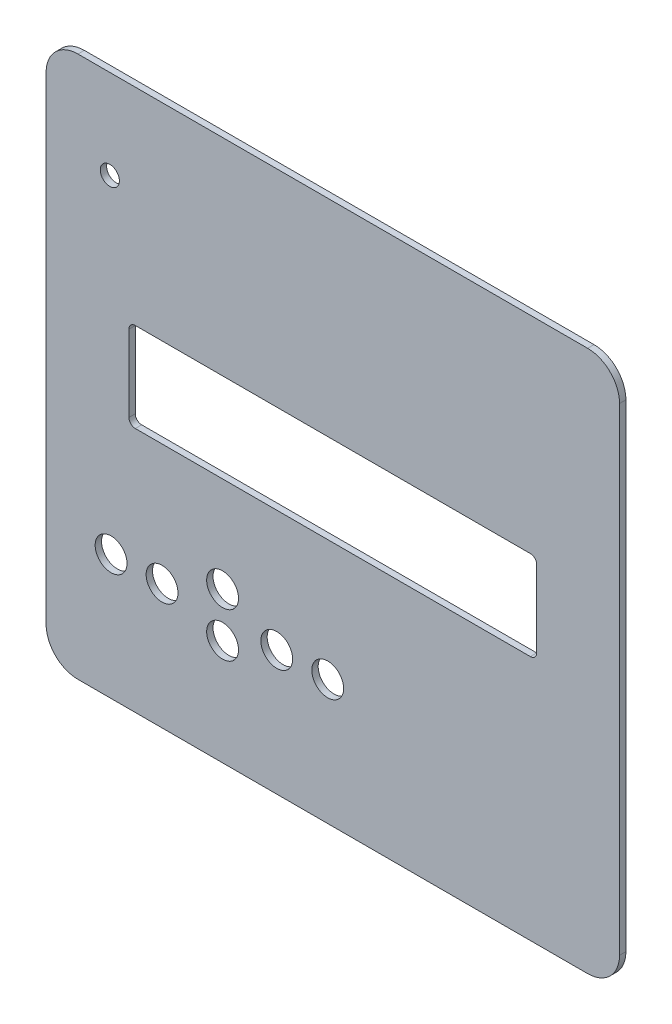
ISO-10303-21;
HEADER;
FILE_DESCRIPTION(('STEP AP214'),'2;1');
FILE_NAME('part.step','',(''),(''),'','','');
FILE_SCHEMA(('AUTOMOTIVE_DESIGN { 1 0 10303 214 1 1 1 1 }'));
ENDSEC;
DATA;
#1=APPLICATION_CONTEXT('core data for automotive mechanical design processes');
#2=APPLICATION_PROTOCOL_DEFINITION('international standard','automotive_design',2000,#1);
#3=PRODUCT_CONTEXT('',#1,'mechanical');
#4=PRODUCT('Part','Part','',(#3));
#5=PRODUCT_RELATED_PRODUCT_CATEGORY('part','',(#4));
#6=PRODUCT_DEFINITION_FORMATION('','',#4);
#7=PRODUCT_DEFINITION_CONTEXT('part definition',#1,'design');
#8=PRODUCT_DEFINITION('design','',#6,#7);
#9=PRODUCT_DEFINITION_SHAPE('','',#8);
#10=(LENGTH_UNIT() NAMED_UNIT(*) SI_UNIT(.MILLI.,.METRE.));
#11=(NAMED_UNIT(*) PLANE_ANGLE_UNIT() SI_UNIT($,.RADIAN.));
#12=(NAMED_UNIT(*) SI_UNIT($,.STERADIAN.) SOLID_ANGLE_UNIT());
#13=UNCERTAINTY_MEASURE_WITH_UNIT(LENGTH_MEASURE(1.E-05),#10,'distance_accuracy_value','');
#14=(GEOMETRIC_REPRESENTATION_CONTEXT(3) GLOBAL_UNCERTAINTY_ASSIGNED_CONTEXT((#13)) GLOBAL_UNIT_ASSIGNED_CONTEXT((#10,
#11,#12)) REPRESENTATION_CONTEXT('',''));
#15=CARTESIAN_POINT('',(0.,0.,0.));
#16=DIRECTION('',(0.,0.,1.));
#17=DIRECTION('',(1.,0.,0.));
#18=AXIS2_PLACEMENT_3D('',#15,#16,#17);
#19=CARTESIAN_POINT('',(40.,-37.5,1.));
#20=DIRECTION('',(0.,0.,-1.));
#21=DIRECTION('',(-1.,0.,0.));
#22=AXIS2_PLACEMENT_3D('',#19,#20,#21);
#23=CYLINDRICAL_SURFACE('',#22,5.);
#24=CARTESIAN_POINT('',(40.,-37.5,0.));
#25=DIRECTION('',(0.,0.,1.));
#26=DIRECTION('',(1.,0.,0.));
#27=AXIS2_PLACEMENT_3D('',#24,#25,#26);
#28=CIRCLE('',#27,5.);
#29=CARTESIAN_POINT('',(40.,-42.5,0.));
#30=VERTEX_POINT('',#29);
#31=CARTESIAN_POINT('',(45.,-37.5,0.));
#32=VERTEX_POINT('',#31);
#33=EDGE_CURVE('E208',#30,#32,#28,.T.);
#34=ORIENTED_EDGE('',*,*,#33,.T.);
#35=DIRECTION('',(0.,0.,-1.));
#36=VECTOR('',#35,1.);
#37=CARTESIAN_POINT('',(45.,-37.5,1.));
#38=LINE('',#37,#36);
#39=CARTESIAN_POINT('',(45.,-37.5,1.));
#40=VERTEX_POINT('',#39);
#41=EDGE_CURVE('E11',#40,#32,#38,.T.);
#42=ORIENTED_EDGE('',*,*,#41,.F.);
#43=CARTESIAN_POINT('',(40.,-37.5,1.));
#44=DIRECTION('',(0.,0.,1.));
#45=DIRECTION('',(1.,0.,0.));
#46=AXIS2_PLACEMENT_3D('',#43,#44,#45);
#47=CIRCLE('',#46,5.);
#48=CARTESIAN_POINT('',(40.,-42.5,1.));
#49=VERTEX_POINT('',#48);
#50=EDGE_CURVE('E220',#49,#40,#47,.T.);
#51=ORIENTED_EDGE('',*,*,#50,.F.);
#52=DIRECTION('',(0.,0.,-1.));
#53=VECTOR('',#52,1.);
#54=CARTESIAN_POINT('',(40.,-42.5,1.));
#55=LINE('',#54,#53);
#56=EDGE_CURVE('E238',#49,#30,#55,.T.);
#57=ORIENTED_EDGE('',*,*,#56,.T.);
#58=EDGE_LOOP('',(#34,#42,#51,#57));
#59=FACE_BOUND('',#58,.T.);
#60=ADVANCED_FACE('F35',(#59),#23,.T.);
#61=CARTESIAN_POINT('',(45.,37.5,1.));
#62=DIRECTION('',(-1.,0.,0.));
#63=DIRECTION('',(0.,-1.,0.));
#64=AXIS2_PLACEMENT_3D('',#61,#62,#63);
#65=PLANE('',#64);
#66=DIRECTION('',(0.,1.,0.));
#67=VECTOR('',#66,1.);
#68=CARTESIAN_POINT('',(45.,37.5,0.));
#69=LINE('',#68,#67);
#70=CARTESIAN_POINT('',(45.,37.5,0.));
#71=VERTEX_POINT('',#70);
#72=EDGE_CURVE('E241',#32,#71,#69,.T.);
#73=ORIENTED_EDGE('',*,*,#72,.T.);
#74=DIRECTION('',(0.,0.,-1.));
#75=VECTOR('',#74,1.);
#76=CARTESIAN_POINT('',(45.,37.5,1.));
#77=LINE('',#76,#75);
#78=CARTESIAN_POINT('',(45.,37.5,1.));
#79=VERTEX_POINT('',#78);
#80=EDGE_CURVE('E42',#79,#71,#77,.T.);
#81=ORIENTED_EDGE('',*,*,#80,.F.);
#82=DIRECTION('',(0.,1.,0.));
#83=VECTOR('',#82,1.);
#84=CARTESIAN_POINT('',(45.,37.5,1.));
#85=LINE('',#84,#83);
#86=EDGE_CURVE('E223',#40,#79,#85,.T.);
#87=ORIENTED_EDGE('',*,*,#86,.F.);
#88=ORIENTED_EDGE('',*,*,#41,.T.);
#89=EDGE_LOOP('',(#73,#81,#87,#88));
#90=FACE_BOUND('',#89,.T.);
#91=ADVANCED_FACE('F296',(#90),#65,.F.);
#92=CARTESIAN_POINT('',(40.,37.5,1.));
#93=DIRECTION('',(0.,0.,-1.));
#94=DIRECTION('',(-1.,0.,0.));
#95=AXIS2_PLACEMENT_3D('',#92,#93,#94);
#96=CYLINDRICAL_SURFACE('',#95,5.);
#97=CARTESIAN_POINT('',(40.,37.5,0.));
#98=DIRECTION('',(0.,0.,1.));
#99=DIRECTION('',(-1.,0.,0.));
#100=AXIS2_PLACEMENT_3D('',#97,#98,#99);
#101=CIRCLE('',#100,5.);
#102=CARTESIAN_POINT('',(39.9999999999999,42.5,0.));
#103=VERTEX_POINT('',#102);
#104=EDGE_CURVE('E243',#71,#103,#101,.T.);
#105=ORIENTED_EDGE('',*,*,#104,.T.);
#106=DIRECTION('',(0.,0.,-1.));
#107=VECTOR('',#106,1.);
#108=CARTESIAN_POINT('',(39.9999999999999,42.5,1.));
#109=LINE('',#108,#107);
#110=CARTESIAN_POINT('',(39.9999999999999,42.5,1.));
#111=VERTEX_POINT('',#110);
#112=EDGE_CURVE('E268',#111,#103,#109,.T.);
#113=ORIENTED_EDGE('',*,*,#112,.F.);
#114=CARTESIAN_POINT('',(40.,37.5,1.));
#115=DIRECTION('',(0.,0.,1.));
#116=DIRECTION('',(-1.,0.,0.));
#117=AXIS2_PLACEMENT_3D('',#114,#115,#116);
#118=CIRCLE('',#117,5.);
#119=EDGE_CURVE('E226',#79,#111,#118,.T.);
#120=ORIENTED_EDGE('',*,*,#119,.F.);
#121=ORIENTED_EDGE('',*,*,#80,.T.);
#122=EDGE_LOOP('',(#105,#113,#120,#121));
#123=FACE_BOUND('',#122,.T.);
#124=ADVANCED_FACE('F275',(#123),#96,.T.);
#125=CARTESIAN_POINT('',(-40.,42.5,1.));
#126=DIRECTION('',(0.,-1.,0.));
#127=DIRECTION('',(0.,0.,-1.));
#128=AXIS2_PLACEMENT_3D('',#125,#126,#127);
#129=PLANE('',#128);
#130=DIRECTION('',(-1.,0.,0.));
#131=VECTOR('',#130,1.);
#132=CARTESIAN_POINT('',(-40.,42.5,0.));
#133=LINE('',#132,#131);
#134=CARTESIAN_POINT('',(-40.,42.5,0.));
#135=VERTEX_POINT('',#134);
#136=EDGE_CURVE('E245',#103,#135,#133,.T.);
#137=ORIENTED_EDGE('',*,*,#136,.T.);
#138=DIRECTION('',(0.,0.,-1.));
#139=VECTOR('',#138,1.);
#140=CARTESIAN_POINT('',(-40.,42.5,1.));
#141=LINE('',#140,#139);
#142=CARTESIAN_POINT('',(-40.,42.5,1.));
#143=VERTEX_POINT('',#142);
#144=EDGE_CURVE('E265',#143,#135,#141,.T.);
#145=ORIENTED_EDGE('',*,*,#144,.F.);
#146=DIRECTION('',(-1.,0.,0.));
#147=VECTOR('',#146,1.);
#148=CARTESIAN_POINT('',(-40.,42.5,1.));
#149=LINE('',#148,#147);
#150=EDGE_CURVE('E228',#111,#143,#149,.T.);
#151=ORIENTED_EDGE('',*,*,#150,.F.);
#152=ORIENTED_EDGE('',*,*,#112,.T.);
#153=EDGE_LOOP('',(#137,#145,#151,#152));
#154=FACE_BOUND('',#153,.T.);
#155=ADVANCED_FACE('F284',(#154),#129,.F.);
#156=CARTESIAN_POINT('',(-40.,37.5,1.));
#157=DIRECTION('',(0.,0.,-1.));
#158=DIRECTION('',(-1.,0.,0.));
#159=AXIS2_PLACEMENT_3D('',#156,#157,#158);
#160=CYLINDRICAL_SURFACE('',#159,5.);
#161=CARTESIAN_POINT('',(-40.,37.5,0.));
#162=DIRECTION('',(0.,0.,1.));
#163=DIRECTION('',(1.,0.,0.));
#164=AXIS2_PLACEMENT_3D('',#161,#162,#163);
#165=CIRCLE('',#164,5.);
#166=CARTESIAN_POINT('',(-45.,37.5,0.));
#167=VERTEX_POINT('',#166);
#168=EDGE_CURVE('E247',#135,#167,#165,.T.);
#169=ORIENTED_EDGE('',*,*,#168,.T.);
#170=DIRECTION('',(0.,0.,-1.));
#171=VECTOR('',#170,1.);
#172=CARTESIAN_POINT('',(-45.,37.5,1.));
#173=LINE('',#172,#171);
#174=CARTESIAN_POINT('',(-45.,37.5,1.));
#175=VERTEX_POINT('',#174);
#176=EDGE_CURVE('E262',#175,#167,#173,.T.);
#177=ORIENTED_EDGE('',*,*,#176,.F.);
#178=CARTESIAN_POINT('',(-40.,37.5,1.));
#179=DIRECTION('',(0.,0.,1.));
#180=DIRECTION('',(1.,0.,0.));
#181=AXIS2_PLACEMENT_3D('',#178,#179,#180);
#182=CIRCLE('',#181,5.);
#183=EDGE_CURVE('E230',#143,#175,#182,.T.);
#184=ORIENTED_EDGE('',*,*,#183,.F.);
#185=ORIENTED_EDGE('',*,*,#144,.T.);
#186=EDGE_LOOP('',(#169,#177,#184,#185));
#187=FACE_BOUND('',#186,.T.);
#188=ADVANCED_FACE('F288',(#187),#160,.T.);
#189=CARTESIAN_POINT('',(-45.,37.5,1.));
#190=DIRECTION('',(1.,0.,0.));
#191=DIRECTION('',(0.,1.,0.));
#192=AXIS2_PLACEMENT_3D('',#189,#190,#191);
#193=PLANE('',#192);
#194=DIRECTION('',(0.,-1.,0.));
#195=VECTOR('',#194,1.);
#196=CARTESIAN_POINT('',(-45.,37.5,0.));
#197=LINE('',#196,#195);
#198=CARTESIAN_POINT('',(-45.,-37.5,0.));
#199=VERTEX_POINT('',#198);
#200=EDGE_CURVE('E249',#167,#199,#197,.T.);
#201=ORIENTED_EDGE('',*,*,#200,.T.);
#202=DIRECTION('',(0.,0.,-1.));
#203=VECTOR('',#202,1.);
#204=CARTESIAN_POINT('',(-45.,-37.5,1.));
#205=LINE('',#204,#203);
#206=CARTESIAN_POINT('',(-45.,-37.5,1.));
#207=VERTEX_POINT('',#206);
#208=EDGE_CURVE('E259',#207,#199,#205,.T.);
#209=ORIENTED_EDGE('',*,*,#208,.F.);
#210=DIRECTION('',(0.,-1.,0.));
#211=VECTOR('',#210,1.);
#212=CARTESIAN_POINT('',(-45.,37.5,1.));
#213=LINE('',#212,#211);
#214=EDGE_CURVE('E232',#175,#207,#213,.T.);
#215=ORIENTED_EDGE('',*,*,#214,.F.);
#216=ORIENTED_EDGE('',*,*,#176,.T.);
#217=EDGE_LOOP('',(#201,#209,#215,#216));
#218=FACE_BOUND('',#217,.T.);
#219=ADVANCED_FACE('F309',(#218),#193,.F.);
#220=CARTESIAN_POINT('',(-40.,-37.5,1.));
#221=DIRECTION('',(0.,0.,-1.));
#222=DIRECTION('',(-1.,0.,0.));
#223=AXIS2_PLACEMENT_3D('',#220,#221,#222);
#224=CYLINDRICAL_SURFACE('',#223,5.);
#225=CARTESIAN_POINT('',(-40.,-37.5,0.));
#226=DIRECTION('',(0.,0.,1.));
#227=DIRECTION('',(1.,0.,0.));
#228=AXIS2_PLACEMENT_3D('',#225,#226,#227);
#229=CIRCLE('',#228,5.);
#230=CARTESIAN_POINT('',(-40.,-42.5,0.));
#231=VERTEX_POINT('',#230);
#232=EDGE_CURVE('E251',#199,#231,#229,.T.);
#233=ORIENTED_EDGE('',*,*,#232,.T.);
#234=DIRECTION('',(0.,0.,-1.));
#235=VECTOR('',#234,1.);
#236=CARTESIAN_POINT('',(-40.,-42.5,1.));
#237=LINE('',#236,#235);
#238=CARTESIAN_POINT('',(-40.,-42.5,1.));
#239=VERTEX_POINT('',#238);
#240=EDGE_CURVE('E256',#239,#231,#237,.T.);
#241=ORIENTED_EDGE('',*,*,#240,.F.);
#242=CARTESIAN_POINT('',(-40.,-37.5,1.));
#243=DIRECTION('',(0.,0.,1.));
#244=DIRECTION('',(1.,0.,0.));
#245=AXIS2_PLACEMENT_3D('',#242,#243,#244);
#246=CIRCLE('',#245,5.);
#247=EDGE_CURVE('E234',#207,#239,#246,.T.);
#248=ORIENTED_EDGE('',*,*,#247,.F.);
#249=ORIENTED_EDGE('',*,*,#208,.T.);
#250=EDGE_LOOP('',(#233,#241,#248,#249));
#251=FACE_BOUND('',#250,.T.);
#252=ADVANCED_FACE('F307',(#251),#224,.T.);
#253=CARTESIAN_POINT('',(-40.,-42.5,1.));
#254=DIRECTION('',(0.,1.,0.));
#255=DIRECTION('',(0.,0.,1.));
#256=AXIS2_PLACEMENT_3D('',#253,#254,#255);
#257=PLANE('',#256);
#258=DIRECTION('',(1.,0.,0.));
#259=VECTOR('',#258,1.);
#260=CARTESIAN_POINT('',(-40.,-42.5,0.));
#261=LINE('',#260,#259);
#262=EDGE_CURVE('E224',#231,#30,#261,.T.);
#263=ORIENTED_EDGE('',*,*,#262,.T.);
#264=ORIENTED_EDGE('',*,*,#56,.F.);
#265=DIRECTION('',(1.,0.,0.));
#266=VECTOR('',#265,1.);
#267=CARTESIAN_POINT('',(-40.,-42.5,1.));
#268=LINE('',#267,#266);
#269=EDGE_CURVE('E236',#239,#49,#268,.T.);
#270=ORIENTED_EDGE('',*,*,#269,.F.);
#271=ORIENTED_EDGE('',*,*,#240,.T.);
#272=EDGE_LOOP('',(#263,#264,#270,#271));
#273=FACE_BOUND('',#272,.T.);
#274=ADVANCED_FACE('F302',(#273),#257,.F.);
#275=CARTESIAN_POINT('',(40.,-37.5,1.));
#276=DIRECTION('',(0.,0.,1.));
#277=DIRECTION('',(1.,0.,0.));
#278=AXIS2_PLACEMENT_3D('',#275,#276,#277);
#279=PLANE('',#278);
#280=CARTESIAN_POINT('',(-35.,28.5,1.));
#281=DIRECTION('',(0.,0.,1.));
#282=DIRECTION('',(1.,0.,0.));
#283=AXIS2_PLACEMENT_3D('',#280,#281,#282);
#284=CIRCLE('',#283,1.5);
#285=CARTESIAN_POINT('',(-33.5,28.5,1.));
#286=VERTEX_POINT('',#285);
#287=EDGE_CURVE('E526',#286,#286,#284,.T.);
#288=ORIENTED_EDGE('',*,*,#287,.F.);
#289=EDGE_LOOP('',(#288));
#290=FACE_BOUND('',#289,.T.);
#291=CARTESIAN_POINT('',(-34.7999999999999,-22.9,1.));
#292=DIRECTION('',(0.,0.,1.));
#293=DIRECTION('',(1.,0.,0.));
#294=AXIS2_PLACEMENT_3D('',#291,#292,#293);
#295=CIRCLE('',#294,2.5);
#296=CARTESIAN_POINT('',(-32.2999999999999,-22.9,1.));
#297=VERTEX_POINT('',#296);
#298=EDGE_CURVE('E531',#297,#297,#295,.T.);
#299=ORIENTED_EDGE('',*,*,#298,.F.);
#300=EDGE_LOOP('',(#299));
#301=FACE_BOUND('',#300,.T.);
#302=CARTESIAN_POINT('',(-26.7999999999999,-22.9,1.));
#303=DIRECTION('',(0.,0.,1.));
#304=DIRECTION('',(1.,0.,0.));
#305=AXIS2_PLACEMENT_3D('',#302,#303,#304);
#306=CIRCLE('',#305,2.5);
#307=CARTESIAN_POINT('',(-24.2999999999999,-22.9,1.));
#308=VERTEX_POINT('',#307);
#309=EDGE_CURVE('E540',#308,#308,#306,.T.);
#310=ORIENTED_EDGE('',*,*,#309,.F.);
#311=EDGE_LOOP('',(#310));
#312=FACE_BOUND('',#311,.T.);
#313=CARTESIAN_POINT('',(-17.2999999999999,-18.9,1.));
#314=DIRECTION('',(0.,0.,1.));
#315=DIRECTION('',(1.,0.,0.));
#316=AXIS2_PLACEMENT_3D('',#313,#314,#315);
#317=CIRCLE('',#316,2.5);
#318=CARTESIAN_POINT('',(-14.7999999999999,-18.9,1.));
#319=VERTEX_POINT('',#318);
#320=EDGE_CURVE('E172',#319,#319,#317,.T.);
#321=ORIENTED_EDGE('',*,*,#320,.F.);
#322=EDGE_LOOP('',(#321));
#323=FACE_BOUND('',#322,.T.);
#324=CARTESIAN_POINT('',(-17.2999999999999,-25.9,1.));
#325=DIRECTION('',(0.,0.,1.));
#326=DIRECTION('',(1.,0.,0.));
#327=AXIS2_PLACEMENT_3D('',#324,#325,#326);
#328=CIRCLE('',#327,2.5);
#329=CARTESIAN_POINT('',(-14.7999999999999,-25.9,1.));
#330=VERTEX_POINT('',#329);
#331=EDGE_CURVE('E551',#330,#330,#328,.T.);
#332=ORIENTED_EDGE('',*,*,#331,.F.);
#333=EDGE_LOOP('',(#332));
#334=FACE_BOUND('',#333,.T.);
#335=CARTESIAN_POINT('',(-8.79999999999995,-22.9,1.));
#336=DIRECTION('',(0.,0.,1.));
#337=DIRECTION('',(1.,0.,0.));
#338=AXIS2_PLACEMENT_3D('',#335,#336,#337);
#339=CIRCLE('',#338,2.5);
#340=CARTESIAN_POINT('',(-6.29999999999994,-22.9,1.));
#341=VERTEX_POINT('',#340);
#342=EDGE_CURVE('E561',#341,#341,#339,.T.);
#343=ORIENTED_EDGE('',*,*,#342,.F.);
#344=EDGE_LOOP('',(#343));
#345=FACE_BOUND('',#344,.T.);
#346=CARTESIAN_POINT('',(-0.79999999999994,-22.9,1.));
#347=DIRECTION('',(0.,0.,1.));
#348=DIRECTION('',(1.,0.,0.));
#349=AXIS2_PLACEMENT_3D('',#346,#347,#348);
#350=CIRCLE('',#349,2.5);
#351=CARTESIAN_POINT('',(1.70000000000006,-22.9,1.));
#352=VERTEX_POINT('',#351);
#353=EDGE_CURVE('E566',#352,#352,#350,.T.);
#354=ORIENTED_EDGE('',*,*,#353,.F.);
#355=EDGE_LOOP('',(#354));
#356=FACE_BOUND('',#355,.T.);
#357=CARTESIAN_POINT('',(-30.9999999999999,9.09999999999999,1.));
#358=DIRECTION('',(0.,0.,1.));
#359=DIRECTION('',(-1.,0.,0.));
#360=AXIS2_PLACEMENT_3D('',#357,#358,#359);
#361=CIRCLE('',#360,1.00000000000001);
#362=CARTESIAN_POINT('',(-31.,10.1,1.));
#363=VERTEX_POINT('',#362);
#364=CARTESIAN_POINT('',(-32.,9.10000000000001,1.));
#365=VERTEX_POINT('',#364);
#366=EDGE_CURVE('E49',#363,#365,#361,.T.);
#367=ORIENTED_EDGE('',*,*,#366,.F.);
#368=DIRECTION('',(-1.,0.,0.));
#369=VECTOR('',#368,1.);
#370=CARTESIAN_POINT('',(-31.,10.1,1.));
#371=LINE('',#370,#369);
#372=CARTESIAN_POINT('',(31.0000000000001,10.1,1.));
#373=VERTEX_POINT('',#372);
#374=EDGE_CURVE('E166',#373,#363,#371,.T.);
#375=ORIENTED_EDGE('',*,*,#374,.F.);
#376=CARTESIAN_POINT('',(31.0000000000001,9.10000000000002,1.));
#377=DIRECTION('',(0.,0.,1.));
#378=DIRECTION('',(-1.,0.,0.));
#379=AXIS2_PLACEMENT_3D('',#376,#377,#378);
#380=CIRCLE('',#379,1.);
#381=CARTESIAN_POINT('',(32.0000000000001,9.10000000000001,1.));
#382=VERTEX_POINT('',#381);
#383=EDGE_CURVE('E169',#382,#373,#380,.T.);
#384=ORIENTED_EDGE('',*,*,#383,.F.);
#385=DIRECTION('',(0.,1.,0.));
#386=VECTOR('',#385,1.);
#387=CARTESIAN_POINT('',(32.0000000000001,9.10000000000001,1.));
#388=LINE('',#387,#386);
#389=CARTESIAN_POINT('',(32.0000000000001,-2.89999999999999,1.));
#390=VERTEX_POINT('',#389);
#391=EDGE_CURVE('E201',#390,#382,#388,.T.);
#392=ORIENTED_EDGE('',*,*,#391,.F.);
#393=CARTESIAN_POINT('',(31.0000000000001,-2.89999999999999,1.));
#394=DIRECTION('',(0.,0.,1.));
#395=DIRECTION('',(1.,0.,0.));
#396=AXIS2_PLACEMENT_3D('',#393,#394,#395);
#397=CIRCLE('',#396,1.);
#398=CARTESIAN_POINT('',(31.0000000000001,-3.89999999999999,1.));
#399=VERTEX_POINT('',#398);
#400=EDGE_CURVE('E198',#399,#390,#397,.T.);
#401=ORIENTED_EDGE('',*,*,#400,.F.);
#402=DIRECTION('',(1.,0.,0.));
#403=VECTOR('',#402,1.);
#404=CARTESIAN_POINT('',(-31.,-3.89999999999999,1.));
#405=LINE('',#404,#403);
#406=CARTESIAN_POINT('',(-31.,-3.89999999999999,1.));
#407=VERTEX_POINT('',#406);
#408=EDGE_CURVE('E195',#407,#399,#405,.T.);
#409=ORIENTED_EDGE('',*,*,#408,.F.);
#410=CARTESIAN_POINT('',(-31.,-2.89999999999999,1.));
#411=DIRECTION('',(0.,0.,1.));
#412=DIRECTION('',(1.,0.,0.));
#413=AXIS2_PLACEMENT_3D('',#410,#411,#412);
#414=CIRCLE('',#413,1.00000000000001);
#415=CARTESIAN_POINT('',(-32.,-2.89999999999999,1.));
#416=VERTEX_POINT('',#415);
#417=EDGE_CURVE('E192',#416,#407,#414,.T.);
#418=ORIENTED_EDGE('',*,*,#417,.F.);
#419=DIRECTION('',(0.,-1.,0.));
#420=VECTOR('',#419,1.);
#421=CARTESIAN_POINT('',(-32.,9.10000000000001,1.));
#422=LINE('',#421,#420);
#423=EDGE_CURVE('E189',#365,#416,#422,.T.);
#424=ORIENTED_EDGE('',*,*,#423,.F.);
#425=EDGE_LOOP('',(#367,#375,#384,#392,#401,#409,#418,#424));
#426=FACE_BOUND('',#425,.T.);
#427=ORIENTED_EDGE('',*,*,#50,.T.);
#428=ORIENTED_EDGE('',*,*,#86,.T.);
#429=ORIENTED_EDGE('',*,*,#119,.T.);
#430=ORIENTED_EDGE('',*,*,#150,.T.);
#431=ORIENTED_EDGE('',*,*,#183,.T.);
#432=ORIENTED_EDGE('',*,*,#214,.T.);
#433=ORIENTED_EDGE('',*,*,#247,.T.);
#434=ORIENTED_EDGE('',*,*,#269,.T.);
#435=EDGE_LOOP('',(#427,#428,#429,#430,#431,#432,#433,#434));
#436=FACE_BOUND('',#435,.T.);
#437=ADVANCED_FACE('F292',(#290,#301,#312,#323,#334,#345,#356,#426,#436),#279,.T.);
#438=CARTESIAN_POINT('',(40.,-37.5,0.));
#439=DIRECTION('',(0.,0.,1.));
#440=DIRECTION('',(1.,0.,0.));
#441=AXIS2_PLACEMENT_3D('',#438,#439,#440);
#442=PLANE('',#441);
#443=CARTESIAN_POINT('',(-35.,28.5,0.));
#444=DIRECTION('',(0.,0.,1.));
#445=DIRECTION('',(1.,0.,0.));
#446=AXIS2_PLACEMENT_3D('',#443,#444,#445);
#447=CIRCLE('',#446,1.5);
#448=CARTESIAN_POINT('',(-33.5,28.5,0.));
#449=VERTEX_POINT('',#448);
#450=EDGE_CURVE('E190',#449,#449,#447,.T.);
#451=ORIENTED_EDGE('',*,*,#450,.T.);
#452=EDGE_LOOP('',(#451));
#453=FACE_BOUND('',#452,.T.);
#454=CARTESIAN_POINT('',(-34.7999999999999,-22.9,0.));
#455=DIRECTION('',(0.,0.,1.));
#456=DIRECTION('',(1.,0.,0.));
#457=AXIS2_PLACEMENT_3D('',#454,#455,#456);
#458=CIRCLE('',#457,2.5);
#459=CARTESIAN_POINT('',(-32.2999999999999,-22.9,0.));
#460=VERTEX_POINT('',#459);
#461=EDGE_CURVE('E527',#460,#460,#458,.T.);
#462=ORIENTED_EDGE('',*,*,#461,.T.);
#463=EDGE_LOOP('',(#462));
#464=FACE_BOUND('',#463,.T.);
#465=CARTESIAN_POINT('',(-26.7999999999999,-22.9,0.));
#466=DIRECTION('',(0.,0.,1.));
#467=DIRECTION('',(1.,0.,0.));
#468=AXIS2_PLACEMENT_3D('',#465,#466,#467);
#469=CIRCLE('',#468,2.5);
#470=CARTESIAN_POINT('',(-24.2999999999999,-22.9,0.));
#471=VERTEX_POINT('',#470);
#472=EDGE_CURVE('E537',#471,#471,#469,.T.);
#473=ORIENTED_EDGE('',*,*,#472,.T.);
#474=EDGE_LOOP('',(#473));
#475=FACE_BOUND('',#474,.T.);
#476=CARTESIAN_POINT('',(-17.2999999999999,-18.9,0.));
#477=DIRECTION('',(0.,0.,1.));
#478=DIRECTION('',(1.,0.,0.));
#479=AXIS2_PLACEMENT_3D('',#476,#477,#478);
#480=CIRCLE('',#479,2.5);
#481=CARTESIAN_POINT('',(-14.7999999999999,-18.9,0.));
#482=VERTEX_POINT('',#481);
#483=EDGE_CURVE('E542',#482,#482,#480,.T.);
#484=ORIENTED_EDGE('',*,*,#483,.T.);
#485=EDGE_LOOP('',(#484));
#486=FACE_BOUND('',#485,.T.);
#487=CARTESIAN_POINT('',(-17.2999999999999,-25.9,0.));
#488=DIRECTION('',(0.,0.,1.));
#489=DIRECTION('',(1.,0.,0.));
#490=AXIS2_PLACEMENT_3D('',#487,#488,#489);
#491=CIRCLE('',#490,2.5);
#492=CARTESIAN_POINT('',(-14.7999999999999,-25.9,0.));
#493=VERTEX_POINT('',#492);
#494=EDGE_CURVE('E547',#493,#493,#491,.T.);
#495=ORIENTED_EDGE('',*,*,#494,.T.);
#496=EDGE_LOOP('',(#495));
#497=FACE_BOUND('',#496,.T.);
#498=CARTESIAN_POINT('',(-8.79999999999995,-22.9,0.));
#499=DIRECTION('',(0.,0.,1.));
#500=DIRECTION('',(1.,0.,0.));
#501=AXIS2_PLACEMENT_3D('',#498,#499,#500);
#502=CIRCLE('',#501,2.5);
#503=CARTESIAN_POINT('',(-6.29999999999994,-22.9,0.));
#504=VERTEX_POINT('',#503);
#505=EDGE_CURVE('E556',#504,#504,#502,.T.);
#506=ORIENTED_EDGE('',*,*,#505,.T.);
#507=EDGE_LOOP('',(#506));
#508=FACE_BOUND('',#507,.T.);
#509=CARTESIAN_POINT('',(-0.79999999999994,-22.9,0.));
#510=DIRECTION('',(0.,0.,1.));
#511=DIRECTION('',(1.,0.,0.));
#512=AXIS2_PLACEMENT_3D('',#509,#510,#511);
#513=CIRCLE('',#512,2.5);
#514=CARTESIAN_POINT('',(1.70000000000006,-22.9,0.));
#515=VERTEX_POINT('',#514);
#516=EDGE_CURVE('E564',#515,#515,#513,.T.);
#517=ORIENTED_EDGE('',*,*,#516,.T.);
#518=EDGE_LOOP('',(#517));
#519=FACE_BOUND('',#518,.T.);
#520=DIRECTION('',(-1.,0.,0.));
#521=VECTOR('',#520,1.);
#522=CARTESIAN_POINT('',(-31.,10.1,0.));
#523=LINE('',#522,#521);
#524=CARTESIAN_POINT('',(31.0000000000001,10.1,0.));
#525=VERTEX_POINT('',#524);
#526=CARTESIAN_POINT('',(-31.,10.1,0.));
#527=VERTEX_POINT('',#526);
#528=EDGE_CURVE('E155',#525,#527,#523,.T.);
#529=ORIENTED_EDGE('',*,*,#528,.T.);
#530=CARTESIAN_POINT('',(-30.9999999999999,9.09999999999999,0.));
#531=DIRECTION('',(0.,0.,1.));
#532=DIRECTION('',(-1.,0.,0.));
#533=AXIS2_PLACEMENT_3D('',#530,#531,#532);
#534=CIRCLE('',#533,1.00000000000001);
#535=CARTESIAN_POINT('',(-32.,9.10000000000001,0.));
#536=VERTEX_POINT('',#535);
#537=EDGE_CURVE('E149',#527,#536,#534,.T.);
#538=ORIENTED_EDGE('',*,*,#537,.T.);
#539=DIRECTION('',(0.,-1.,0.));
#540=VECTOR('',#539,1.);
#541=CARTESIAN_POINT('',(-32.,9.10000000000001,0.));
#542=LINE('',#541,#540);
#543=CARTESIAN_POINT('',(-32.,-2.89999999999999,0.));
#544=VERTEX_POINT('',#543);
#545=EDGE_CURVE('E158',#536,#544,#542,.T.);
#546=ORIENTED_EDGE('',*,*,#545,.T.);
#547=CARTESIAN_POINT('',(-31.,-2.89999999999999,0.));
#548=DIRECTION('',(0.,0.,1.));
#549=DIRECTION('',(1.,0.,0.));
#550=AXIS2_PLACEMENT_3D('',#547,#548,#549);
#551=CIRCLE('',#550,1.00000000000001);
#552=CARTESIAN_POINT('',(-31.,-3.89999999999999,0.));
#553=VERTEX_POINT('',#552);
#554=EDGE_CURVE('E57',#544,#553,#551,.T.);
#555=ORIENTED_EDGE('',*,*,#554,.T.);
#556=DIRECTION('',(1.,0.,0.));
#557=VECTOR('',#556,1.);
#558=CARTESIAN_POINT('',(-31.,-3.89999999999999,0.));
#559=LINE('',#558,#557);
#560=CARTESIAN_POINT('',(31.0000000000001,-3.89999999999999,0.));
#561=VERTEX_POINT('',#560);
#562=EDGE_CURVE('E176',#553,#561,#559,.T.);
#563=ORIENTED_EDGE('',*,*,#562,.T.);
#564=CARTESIAN_POINT('',(31.0000000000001,-2.89999999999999,0.));
#565=DIRECTION('',(0.,0.,1.));
#566=DIRECTION('',(1.,0.,0.));
#567=AXIS2_PLACEMENT_3D('',#564,#565,#566);
#568=CIRCLE('',#567,1.);
#569=CARTESIAN_POINT('',(32.0000000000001,-2.89999999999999,0.));
#570=VERTEX_POINT('',#569);
#571=EDGE_CURVE('E179',#561,#570,#568,.T.);
#572=ORIENTED_EDGE('',*,*,#571,.T.);
#573=DIRECTION('',(0.,1.,0.));
#574=VECTOR('',#573,1.);
#575=CARTESIAN_POINT('',(32.0000000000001,9.10000000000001,0.));
#576=LINE('',#575,#574);
#577=CARTESIAN_POINT('',(32.0000000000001,9.10000000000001,0.));
#578=VERTEX_POINT('',#577);
#579=EDGE_CURVE('E182',#570,#578,#576,.T.);
#580=ORIENTED_EDGE('',*,*,#579,.T.);
#581=CARTESIAN_POINT('',(31.0000000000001,9.10000000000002,0.));
#582=DIRECTION('',(0.,0.,1.));
#583=DIRECTION('',(-1.,0.,0.));
#584=AXIS2_PLACEMENT_3D('',#581,#582,#583);
#585=CIRCLE('',#584,1.);
#586=EDGE_CURVE('E185',#578,#525,#585,.T.);
#587=ORIENTED_EDGE('',*,*,#586,.T.);
#588=EDGE_LOOP('',(#529,#538,#546,#555,#563,#572,#580,#587));
#589=FACE_BOUND('',#588,.T.);
#590=ORIENTED_EDGE('',*,*,#33,.F.);
#591=ORIENTED_EDGE('',*,*,#262,.F.);
#592=ORIENTED_EDGE('',*,*,#232,.F.);
#593=ORIENTED_EDGE('',*,*,#200,.F.);
#594=ORIENTED_EDGE('',*,*,#168,.F.);
#595=ORIENTED_EDGE('',*,*,#136,.F.);
#596=ORIENTED_EDGE('',*,*,#104,.F.);
#597=ORIENTED_EDGE('',*,*,#72,.F.);
#598=EDGE_LOOP('',(#590,#591,#592,#593,#594,#595,#596,#597));
#599=FACE_BOUND('',#598,.T.);
#600=ADVANCED_FACE('F162',(#453,#464,#475,#486,#497,#508,#519,#589,#599),#442,.F.);
#601=CARTESIAN_POINT('',(-30.9999999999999,9.09999999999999,0.));
#602=DIRECTION('',(0.,0.,1.));
#603=DIRECTION('',(1.,0.,0.));
#604=AXIS2_PLACEMENT_3D('',#601,#602,#603);
#605=CYLINDRICAL_SURFACE('',#604,1.00000000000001);
#606=ORIENTED_EDGE('',*,*,#366,.T.);
#607=DIRECTION('',(0.,0.,1.));
#608=VECTOR('',#607,1.);
#609=CARTESIAN_POINT('',(-32.,9.10000000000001,0.));
#610=LINE('',#609,#608);
#611=EDGE_CURVE('E145',#536,#365,#610,.T.);
#612=ORIENTED_EDGE('',*,*,#611,.F.);
#613=ORIENTED_EDGE('',*,*,#537,.F.);
#614=DIRECTION('',(0.,0.,1.));
#615=VECTOR('',#614,1.);
#616=CARTESIAN_POINT('',(-31.,10.1,0.));
#617=LINE('',#616,#615);
#618=EDGE_CURVE('E206',#527,#363,#617,.T.);
#619=ORIENTED_EDGE('',*,*,#618,.T.);
#620=EDGE_LOOP('',(#606,#612,#613,#619));
#621=FACE_BOUND('',#620,.T.);
#622=ADVANCED_FACE('F147',(#621),#605,.F.);
#623=CARTESIAN_POINT('',(-31.,10.1,0.));
#624=DIRECTION('',(0.,1.,0.));
#625=DIRECTION('',(-1.,0.,0.));
#626=AXIS2_PLACEMENT_3D('',#623,#624,#625);
#627=PLANE('',#626);
#628=ORIENTED_EDGE('',*,*,#374,.T.);
#629=ORIENTED_EDGE('',*,*,#618,.F.);
#630=ORIENTED_EDGE('',*,*,#528,.F.);
#631=DIRECTION('',(0.,0.,1.));
#632=VECTOR('',#631,1.);
#633=CARTESIAN_POINT('',(31.0000000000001,10.1,0.));
#634=LINE('',#633,#632);
#635=EDGE_CURVE('E209',#525,#373,#634,.T.);
#636=ORIENTED_EDGE('',*,*,#635,.T.);
#637=EDGE_LOOP('',(#628,#629,#630,#636));
#638=FACE_BOUND('',#637,.T.);
#639=ADVANCED_FACE('F381',(#638),#627,.F.);
#640=CARTESIAN_POINT('',(31.0000000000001,9.10000000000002,0.));
#641=DIRECTION('',(0.,0.,1.));
#642=DIRECTION('',(1.,0.,0.));
#643=AXIS2_PLACEMENT_3D('',#640,#641,#642);
#644=CYLINDRICAL_SURFACE('',#643,1.);
#645=ORIENTED_EDGE('',*,*,#383,.T.);
#646=ORIENTED_EDGE('',*,*,#635,.F.);
#647=ORIENTED_EDGE('',*,*,#586,.F.);
#648=DIRECTION('',(0.,0.,1.));
#649=VECTOR('',#648,1.);
#650=CARTESIAN_POINT('',(32.0000000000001,9.10000000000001,0.));
#651=LINE('',#650,#649);
#652=EDGE_CURVE('E211',#578,#382,#651,.T.);
#653=ORIENTED_EDGE('',*,*,#652,.T.);
#654=EDGE_LOOP('',(#645,#646,#647,#653));
#655=FACE_BOUND('',#654,.T.);
#656=ADVANCED_FACE('F390',(#655),#644,.F.);
#657=CARTESIAN_POINT('',(32.0000000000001,9.10000000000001,0.));
#658=DIRECTION('',(1.,0.,0.));
#659=DIRECTION('',(0.,0.,-1.));
#660=AXIS2_PLACEMENT_3D('',#657,#658,#659);
#661=PLANE('',#660);
#662=ORIENTED_EDGE('',*,*,#391,.T.);
#663=ORIENTED_EDGE('',*,*,#652,.F.);
#664=ORIENTED_EDGE('',*,*,#579,.F.);
#665=DIRECTION('',(0.,0.,1.));
#666=VECTOR('',#665,1.);
#667=CARTESIAN_POINT('',(32.0000000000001,-2.89999999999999,0.));
#668=LINE('',#667,#666);
#669=EDGE_CURVE('E213',#570,#390,#668,.T.);
#670=ORIENTED_EDGE('',*,*,#669,.T.);
#671=EDGE_LOOP('',(#662,#663,#664,#670));
#672=FACE_BOUND('',#671,.T.);
#673=ADVANCED_FACE('F400',(#672),#661,.F.);
#674=CARTESIAN_POINT('',(31.0000000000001,-2.89999999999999,0.));
#675=DIRECTION('',(0.,0.,1.));
#676=DIRECTION('',(1.,0.,0.));
#677=AXIS2_PLACEMENT_3D('',#674,#675,#676);
#678=CYLINDRICAL_SURFACE('',#677,1.);
#679=ORIENTED_EDGE('',*,*,#400,.T.);
#680=ORIENTED_EDGE('',*,*,#669,.F.);
#681=ORIENTED_EDGE('',*,*,#571,.F.);
#682=DIRECTION('',(0.,0.,1.));
#683=VECTOR('',#682,1.);
#684=CARTESIAN_POINT('',(31.0000000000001,-3.89999999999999,0.));
#685=LINE('',#684,#683);
#686=EDGE_CURVE('E215',#561,#399,#685,.T.);
#687=ORIENTED_EDGE('',*,*,#686,.T.);
#688=EDGE_LOOP('',(#679,#680,#681,#687));
#689=FACE_BOUND('',#688,.T.);
#690=ADVANCED_FACE('F410',(#689),#678,.F.);
#691=CARTESIAN_POINT('',(-31.,-3.89999999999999,0.));
#692=DIRECTION('',(0.,-1.,0.));
#693=DIRECTION('',(0.,0.,-1.));
#694=AXIS2_PLACEMENT_3D('',#691,#692,#693);
#695=PLANE('',#694);
#696=ORIENTED_EDGE('',*,*,#408,.T.);
#697=ORIENTED_EDGE('',*,*,#686,.F.);
#698=ORIENTED_EDGE('',*,*,#562,.F.);
#699=DIRECTION('',(0.,0.,1.));
#700=VECTOR('',#699,1.);
#701=CARTESIAN_POINT('',(-31.,-3.89999999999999,0.));
#702=LINE('',#701,#700);
#703=EDGE_CURVE('E217',#553,#407,#702,.T.);
#704=ORIENTED_EDGE('',*,*,#703,.T.);
#705=EDGE_LOOP('',(#696,#697,#698,#704));
#706=FACE_BOUND('',#705,.T.);
#707=ADVANCED_FACE('F420',(#706),#695,.F.);
#708=CARTESIAN_POINT('',(-31.,-2.89999999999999,0.));
#709=DIRECTION('',(0.,0.,1.));
#710=DIRECTION('',(1.,0.,0.));
#711=AXIS2_PLACEMENT_3D('',#708,#709,#710);
#712=CYLINDRICAL_SURFACE('',#711,1.00000000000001);
#713=ORIENTED_EDGE('',*,*,#417,.T.);
#714=ORIENTED_EDGE('',*,*,#703,.F.);
#715=ORIENTED_EDGE('',*,*,#554,.F.);
#716=DIRECTION('',(0.,0.,1.));
#717=VECTOR('',#716,1.);
#718=CARTESIAN_POINT('',(-32.,-2.89999999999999,0.));
#719=LINE('',#718,#717);
#720=EDGE_CURVE('E154',#544,#416,#719,.T.);
#721=ORIENTED_EDGE('',*,*,#720,.T.);
#722=EDGE_LOOP('',(#713,#714,#715,#721));
#723=FACE_BOUND('',#722,.T.);
#724=ADVANCED_FACE('F430',(#723),#712,.F.);
#725=CARTESIAN_POINT('',(-32.,9.10000000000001,0.));
#726=DIRECTION('',(-1.,0.,0.));
#727=DIRECTION('',(0.,0.,1.));
#728=AXIS2_PLACEMENT_3D('',#725,#726,#727);
#729=PLANE('',#728);
#730=ORIENTED_EDGE('',*,*,#423,.T.);
#731=ORIENTED_EDGE('',*,*,#720,.F.);
#732=ORIENTED_EDGE('',*,*,#545,.F.);
#733=ORIENTED_EDGE('',*,*,#611,.T.);
#734=EDGE_LOOP('',(#730,#731,#732,#733));
#735=FACE_BOUND('',#734,.T.);
#736=ADVANCED_FACE('F159',(#735),#729,.F.);
#737=CARTESIAN_POINT('',(-0.79999999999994,-22.9,0.));
#738=DIRECTION('',(0.,0.,1.));
#739=DIRECTION('',(1.,0.,0.));
#740=AXIS2_PLACEMENT_3D('',#737,#738,#739);
#741=CYLINDRICAL_SURFACE('',#740,2.5);
#742=ORIENTED_EDGE('',*,*,#516,.F.);
#743=EDGE_LOOP('',(#742));
#744=FACE_BOUND('',#743,.T.);
#745=ORIENTED_EDGE('',*,*,#353,.T.);
#746=EDGE_LOOP('',(#745));
#747=FACE_BOUND('',#746,.T.);
#748=ADVANCED_FACE('F448',(#744,#747),#741,.F.);
#749=CARTESIAN_POINT('',(-8.79999999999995,-22.9,0.));
#750=DIRECTION('',(0.,0.,1.));
#751=DIRECTION('',(1.,0.,0.));
#752=AXIS2_PLACEMENT_3D('',#749,#750,#751);
#753=CYLINDRICAL_SURFACE('',#752,2.5);
#754=ORIENTED_EDGE('',*,*,#505,.F.);
#755=EDGE_LOOP('',(#754));
#756=FACE_BOUND('',#755,.T.);
#757=ORIENTED_EDGE('',*,*,#342,.T.);
#758=EDGE_LOOP('',(#757));
#759=FACE_BOUND('',#758,.T.);
#760=ADVANCED_FACE('F457',(#756,#759),#753,.F.);
#761=CARTESIAN_POINT('',(-17.2999999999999,-25.9,0.));
#762=DIRECTION('',(0.,0.,1.));
#763=DIRECTION('',(1.,0.,0.));
#764=AXIS2_PLACEMENT_3D('',#761,#762,#763);
#765=CYLINDRICAL_SURFACE('',#764,2.5);
#766=ORIENTED_EDGE('',*,*,#494,.F.);
#767=EDGE_LOOP('',(#766));
#768=FACE_BOUND('',#767,.T.);
#769=ORIENTED_EDGE('',*,*,#331,.T.);
#770=EDGE_LOOP('',(#769));
#771=FACE_BOUND('',#770,.T.);
#772=ADVANCED_FACE('F467',(#768,#771),#765,.F.);
#773=CARTESIAN_POINT('',(-17.2999999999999,-18.9,0.));
#774=DIRECTION('',(0.,0.,1.));
#775=DIRECTION('',(1.,0.,0.));
#776=AXIS2_PLACEMENT_3D('',#773,#774,#775);
#777=CYLINDRICAL_SURFACE('',#776,2.5);
#778=ORIENTED_EDGE('',*,*,#483,.F.);
#779=EDGE_LOOP('',(#778));
#780=FACE_BOUND('',#779,.T.);
#781=ORIENTED_EDGE('',*,*,#320,.T.);
#782=EDGE_LOOP('',(#781));
#783=FACE_BOUND('',#782,.T.);
#784=ADVANCED_FACE('F477',(#780,#783),#777,.F.);
#785=CARTESIAN_POINT('',(-26.7999999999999,-22.9,0.));
#786=DIRECTION('',(0.,0.,1.));
#787=DIRECTION('',(1.,0.,0.));
#788=AXIS2_PLACEMENT_3D('',#785,#786,#787);
#789=CYLINDRICAL_SURFACE('',#788,2.5);
#790=ORIENTED_EDGE('',*,*,#472,.F.);
#791=EDGE_LOOP('',(#790));
#792=FACE_BOUND('',#791,.T.);
#793=ORIENTED_EDGE('',*,*,#309,.T.);
#794=EDGE_LOOP('',(#793));
#795=FACE_BOUND('',#794,.T.);
#796=ADVANCED_FACE('F487',(#792,#795),#789,.F.);
#797=CARTESIAN_POINT('',(-34.7999999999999,-22.9,0.));
#798=DIRECTION('',(0.,0.,1.));
#799=DIRECTION('',(1.,0.,0.));
#800=AXIS2_PLACEMENT_3D('',#797,#798,#799);
#801=CYLINDRICAL_SURFACE('',#800,2.5);
#802=ORIENTED_EDGE('',*,*,#461,.F.);
#803=EDGE_LOOP('',(#802));
#804=FACE_BOUND('',#803,.T.);
#805=ORIENTED_EDGE('',*,*,#298,.T.);
#806=EDGE_LOOP('',(#805));
#807=FACE_BOUND('',#806,.T.);
#808=ADVANCED_FACE('F497',(#804,#807),#801,.F.);
#809=CARTESIAN_POINT('',(-35.,28.5,0.));
#810=DIRECTION('',(0.,0.,1.));
#811=DIRECTION('',(1.,0.,0.));
#812=AXIS2_PLACEMENT_3D('',#809,#810,#811);
#813=CYLINDRICAL_SURFACE('',#812,1.5);
#814=ORIENTED_EDGE('',*,*,#450,.F.);
#815=EDGE_LOOP('',(#814));
#816=FACE_BOUND('',#815,.T.);
#817=ORIENTED_EDGE('',*,*,#287,.T.);
#818=EDGE_LOOP('',(#817));
#819=FACE_BOUND('',#818,.T.);
#820=ADVANCED_FACE('F507',(#816,#819),#813,.F.);
#821=CLOSED_SHELL('',(#60,#91,#124,#155,#188,#219,#252,#274,#437,#600,#622,#639,#656,#673,#690,
#707,#724,#736,#748,#760,#772,#784,#796,#808,#820));
#822=MANIFOLD_SOLID_BREP('B2',#821);
#823=ADVANCED_BREP_SHAPE_REPRESENTATION('',(#18,#822),#14);
#824=SHAPE_DEFINITION_REPRESENTATION(#9,#823);
ENDSEC;
END-ISO-10303-21;
